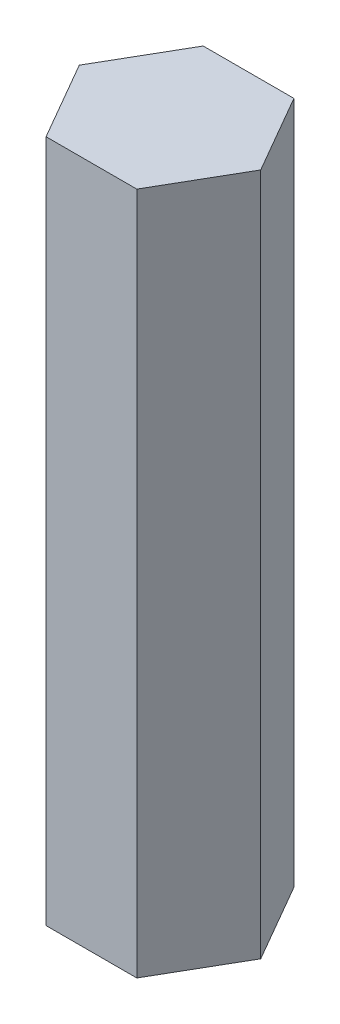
from build123d import *

# Parameters (mm, degrees)
EXTRUDE_1_DEPTH = 25


with BuildPart() as part:
    # Sketch 1 → Extrude 1 (new body)
    with BuildSketch(Plane(origin=(0, 0, 0), x_dir=(1, 0, 0), z_dir=(0, 1, 0))):
        Polygon((1.659815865, -2.875038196), (3.319764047, -7.6393e-05), (1.659948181, 2.874961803), (-1.659815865, 2.875038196), (-3.319764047, 7.6393e-05), (-1.659948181, -2.874961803), align=None)
    extrude(amount=EXTRUDE_1_DEPTH)


solid = part.part
